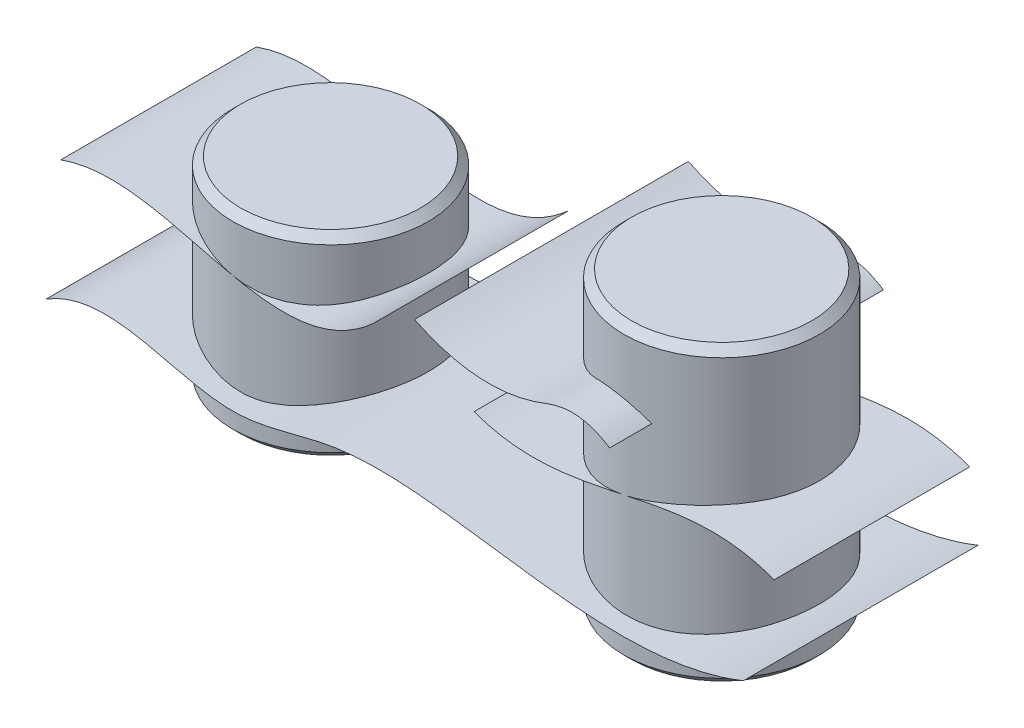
from build123d import *

# Parameters (mm, degrees)
SKETCH1_R           = 25
BOSS_EXTRUDE1_DEPTH = 50
SKETCH2_R           = 25
BOSS_EXTRUDE2_DEPTH = 75
CHAMFER1_SIZE       = 2
CHAMFER2_SIZE       = 2


with BuildPart() as part:
    # Sketch1 → Boss-Extrude1 (new body)
    with BuildSketch(Plane(origin=(0, 0, 0), x_dir=(1, 0, 0), z_dir=(0, 1, 0))):
        with Locations(Location((0, 0, 0), (0, 0, 270))):
            Circle(SKETCH1_R)
    extrude(amount=BOSS_EXTRUDE1_DEPTH)

    # Chamfer1
    chamfer1_edges = [part.edges().sort_by_distance(p)[0] for p in [
        (0, 0, -25),
        (0, 50, -25),
    ]]
    chamfer(chamfer1_edges, length=CHAMFER1_SIZE)


with BuildPart() as body_2:
    # Sketch2 → Boss-Extrude2 (new body)
    with BuildSketch(Plane(origin=(0, 0, 0), x_dir=(1, 0, 0), z_dir=(0, 1, 0))):
        with Locations(Location((100, 0, 0), (0, 0, 270))):
            Circle(SKETCH2_R)
    extrude(amount=BOSS_EXTRUDE2_DEPTH)

    # Chamfer2
    chamfer2_edges = [body_2.edges().sort_by_distance(p)[0] for p in [
        (100, 0, -25),
        (100, 75, -25),
    ]]
    chamfer(chamfer2_edges, length=CHAMFER2_SIZE)


solid = Compound([part.part, body_2.part])
